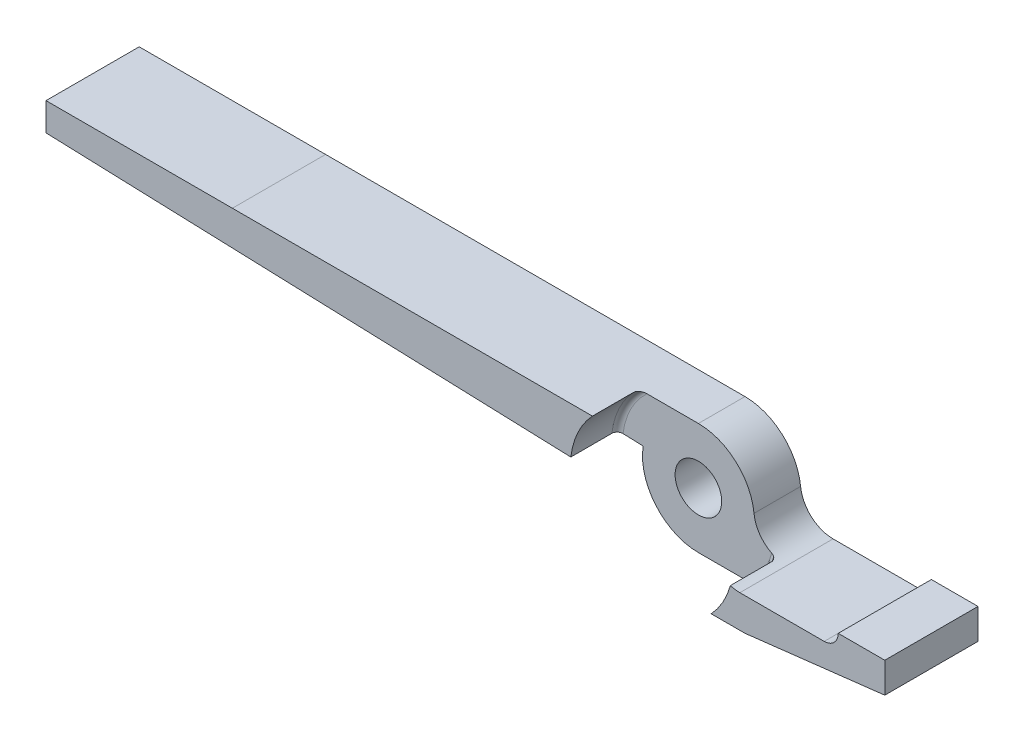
ISO-10303-21;
HEADER;
FILE_DESCRIPTION(('STEP AP214'),'2;1');
FILE_NAME('part.step','',(''),(''),'','','');
FILE_SCHEMA(('AUTOMOTIVE_DESIGN { 1 0 10303 214 1 1 1 1 }'));
ENDSEC;
DATA;
#1=APPLICATION_CONTEXT('core data for automotive mechanical design processes');
#2=APPLICATION_PROTOCOL_DEFINITION('international standard','automotive_design',2000,#1);
#3=PRODUCT_CONTEXT('',#1,'mechanical');
#4=PRODUCT('Part','Part','',(#3));
#5=PRODUCT_RELATED_PRODUCT_CATEGORY('part','',(#4));
#6=PRODUCT_DEFINITION_FORMATION('','',#4);
#7=PRODUCT_DEFINITION_CONTEXT('part definition',#1,'design');
#8=PRODUCT_DEFINITION('design','',#6,#7);
#9=PRODUCT_DEFINITION_SHAPE('','',#8);
#10=(LENGTH_UNIT() NAMED_UNIT(*) SI_UNIT(.MILLI.,.METRE.));
#11=(NAMED_UNIT(*) PLANE_ANGLE_UNIT() SI_UNIT($,.RADIAN.));
#12=(NAMED_UNIT(*) SI_UNIT($,.STERADIAN.) SOLID_ANGLE_UNIT());
#13=UNCERTAINTY_MEASURE_WITH_UNIT(LENGTH_MEASURE(1.E-05),#10,'distance_accuracy_value','');
#14=(GEOMETRIC_REPRESENTATION_CONTEXT(3) GLOBAL_UNCERTAINTY_ASSIGNED_CONTEXT((#13)) GLOBAL_UNIT_ASSIGNED_CONTEXT((#10,
#11,#12)) REPRESENTATION_CONTEXT('',''));
#15=CARTESIAN_POINT('',(0.,0.,0.));
#16=DIRECTION('',(0.,0.,1.));
#17=DIRECTION('',(1.,0.,0.));
#18=AXIS2_PLACEMENT_3D('',#15,#16,#17);
#19=CARTESIAN_POINT('',(-165.1,7.62,25.4));
#20=DIRECTION('',(0.034899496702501,0.999390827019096,0.));
#21=DIRECTION('',(-0.999390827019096,0.034899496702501,0.));
#22=AXIS2_PLACEMENT_3D('',#19,#20,#21);
#23=PLANE('',#22);
#24=DIRECTION('',(0.,0.,1.));
#25=VECTOR('',#24,1.);
#26=CARTESIAN_POINT('',(-160.023094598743,7.44271055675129,25.4));
#27=LINE('',#26,#25);
#28=CARTESIAN_POINT('',(-160.023094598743,7.44271055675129,0.));
#29=VERTEX_POINT('',#28);
#30=CARTESIAN_POINT('',(-160.023094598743,7.44271055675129,25.4));
#31=VERTEX_POINT('',#30);
#32=EDGE_CURVE('E11',#29,#31,#27,.T.);
#33=ORIENTED_EDGE('',*,*,#32,.F.);
#34=DIRECTION('',(0.999390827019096,-0.034899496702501,0.));
#35=VECTOR('',#34,1.);
#36=CARTESIAN_POINT('',(-165.1,7.62,0.));
#37=LINE('',#36,#35);
#38=CARTESIAN_POINT('',(-15.0529746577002,2.38024241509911,0.));
#39=VERTEX_POINT('',#38);
#40=EDGE_CURVE('E282',#29,#39,#37,.T.);
#41=ORIENTED_EDGE('',*,*,#40,.T.);
#42=DIRECTION('',(0.,0.,-1.));
#43=VECTOR('',#42,1.);
#44=CARTESIAN_POINT('',(-15.0529746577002,2.38024241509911,25.4));
#45=LINE('',#44,#43);
#46=CARTESIAN_POINT('',(-15.0529746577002,2.38024241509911,12.7));
#47=VERTEX_POINT('',#46);
#48=EDGE_CURVE('E288',#47,#39,#45,.T.);
#49=ORIENTED_EDGE('',*,*,#48,.F.);
#50=DIRECTION('',(0.999390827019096,-0.034899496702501,0.));
#51=VECTOR('',#50,1.);
#52=CARTESIAN_POINT('',(-165.1,7.62,12.7));
#53=LINE('',#52,#51);
#54=CARTESIAN_POINT('',(-20.5406148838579,2.5718750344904,12.7));
#55=VERTEX_POINT('',#54);
#56=EDGE_CURVE('E212',#55,#47,#53,.T.);
#57=ORIENTED_EDGE('',*,*,#56,.F.);
#58=CARTESIAN_POINT('',(-20.5406148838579,2.57187503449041,12.7));
#59=CARTESIAN_POINT('',(-20.5837496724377,2.57338133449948,12.700000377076));
#60=CARTESIAN_POINT('',(-20.6268638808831,2.57488691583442,12.7018199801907));
#61=CARTESIAN_POINT('',(-20.7127849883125,2.57788734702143,12.7090802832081));
#62=CARTESIAN_POINT('',(-20.7555918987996,2.5793821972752,12.714520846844));
#63=CARTESIAN_POINT('',(-20.8830273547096,2.58383234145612,12.7362260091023));
#64=CARTESIAN_POINT('',(-20.9668041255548,2.58675789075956,12.7578742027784));
#65=CARTESIAN_POINT('',(-21.1295365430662,2.59244063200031,12.8149439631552));
#66=CARTESIAN_POINT('',(-21.2084896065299,2.5951977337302,12.8503728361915));
#67=CARTESIAN_POINT('',(-21.3593097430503,2.60046448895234,12.9340122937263));
#68=CARTESIAN_POINT('',(-21.4311783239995,2.60297419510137,12.9822201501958));
#69=CARTESIAN_POINT('',(-21.5656313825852,2.6076693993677,13.0899565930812));
#70=CARTESIAN_POINT('',(-21.6282341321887,2.60985553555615,13.1494623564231));
#71=CARTESIAN_POINT('',(-21.7425370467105,2.6138470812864,13.2781943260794));
#72=CARTESIAN_POINT('',(-21.7942351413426,2.61565241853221,13.3474223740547));
#73=CARTESIAN_POINT('',(-21.8850550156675,2.61882391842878,13.49336200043));
#74=CARTESIAN_POINT('',(-21.9242187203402,2.6201915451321,13.5700474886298));
#75=CARTESIAN_POINT('',(-21.9890566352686,2.62245573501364,13.7289067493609));
#76=CARTESIAN_POINT('',(-22.014739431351,2.62335259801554,13.811076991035));
#77=CARTESIAN_POINT('',(-22.045309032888,2.62442011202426,13.9488164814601));
#78=CARTESIAN_POINT('',(-22.0543395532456,2.62473546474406,14.0035003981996));
#79=CARTESIAN_POINT('',(-22.0663864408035,2.62515615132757,14.1134483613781));
#80=CARTESIAN_POINT('',(-22.0694113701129,2.62526178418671,14.1687114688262));
#81=CARTESIAN_POINT('',(-22.0694047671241,2.62526155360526,14.224));
#82=B_SPLINE_CURVE_WITH_KNOTS('',3,(#58,#59,#60,#61,#62,#63,#64,#65,#66,#67,#68,#69,#70,#71,#72,
#73,#74,#75,#76,#77,#78,#79,#80,#81),.UNSPECIFIED.,.F.,.F.,(4,2,2,2,2,2,2,2,2,2,2,4),(0.,
0.12940394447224,0.258803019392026,0.51720551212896,0.77574519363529,1.03422972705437,
1.29219754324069,1.5502142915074,1.8073587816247,2.06433930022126,2.23030936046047,
2.39604262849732),.UNSPECIFIED.);
#83=CARTESIAN_POINT('',(-22.0694047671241,2.62526155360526,14.224));
#84=VERTEX_POINT('',#83);
#85=EDGE_CURVE('E349',#55,#84,#82,.T.);
#86=ORIENTED_EDGE('',*,*,#85,.T.);
#87=DIRECTION('',(0.,0.,1.));
#88=VECTOR('',#87,1.);
#89=CARTESIAN_POINT('',(-22.0694047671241,2.62526155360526,12.7));
#90=LINE('',#89,#88);
#91=CARTESIAN_POINT('',(-22.0694047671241,2.62526155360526,25.4));
#92=VERTEX_POINT('',#91);
#93=EDGE_CURVE('E224',#84,#92,#90,.T.);
#94=ORIENTED_EDGE('',*,*,#93,.T.);
#95=DIRECTION('',(0.999390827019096,-0.034899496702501,0.));
#96=VECTOR('',#95,1.);
#97=CARTESIAN_POINT('',(-165.1,7.62,25.4));
#98=LINE('',#97,#96);
#99=EDGE_CURVE('E262',#31,#92,#98,.T.);
#100=ORIENTED_EDGE('',*,*,#99,.F.);
#101=EDGE_LOOP('',(#33,#41,#49,#57,#86,#94,#100));
#102=FACE_BOUND('',#101,.T.);
#103=ADVANCED_FACE('F38',(#102),#23,.F.);
#104=CARTESIAN_POINT('',(-165.1,15.24,25.4));
#105=DIRECTION('',(0.,-1.,0.));
#106=DIRECTION('',(1.,0.,0.));
#107=AXIS2_PLACEMENT_3D('',#104,#105,#106);
#108=PLANE('',#107);
#109=DIRECTION('',(0.,0.,-1.));
#110=VECTOR('',#109,1.);
#111=CARTESIAN_POINT('',(-114.3,15.24,25.4));
#112=LINE('',#111,#110);
#113=CARTESIAN_POINT('',(-114.3,15.24,25.4));
#114=VERTEX_POINT('',#113);
#115=CARTESIAN_POINT('',(-114.3,15.24,0.));
#116=VERTEX_POINT('',#115);
#117=EDGE_CURVE('E47',#114,#116,#112,.T.);
#118=ORIENTED_EDGE('',*,*,#117,.F.);
#119=DIRECTION('',(-1.,0.,0.));
#120=VECTOR('',#119,1.);
#121=CARTESIAN_POINT('',(-165.1,15.24,25.4));
#122=LINE('',#121,#120);
#123=CARTESIAN_POINT('',(-16.1769287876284,15.24,25.4));
#124=VERTEX_POINT('',#123);
#125=EDGE_CURVE('E257',#124,#114,#122,.T.);
#126=ORIENTED_EDGE('',*,*,#125,.F.);
#127=DIRECTION('',(0.,0.,1.));
#128=VECTOR('',#127,1.);
#129=CARTESIAN_POINT('',(-16.1769287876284,15.24,12.7));
#130=LINE('',#129,#128);
#131=CARTESIAN_POINT('',(-16.1769287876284,15.24,14.224));
#132=VERTEX_POINT('',#131);
#133=EDGE_CURVE('E227',#124,#132,#130,.F.);
#134=ORIENTED_EDGE('',*,*,#133,.T.);
#135=CARTESIAN_POINT('',(-16.1769287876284,15.24,14.224));
#136=CARTESIAN_POINT('',(-16.1769395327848,15.24,14.1894360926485));
#137=CARTESIAN_POINT('',(-16.175313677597,15.24,14.1548778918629));
#138=CARTESIAN_POINT('',(-16.1688713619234,15.24,14.0860823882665));
#139=CARTESIAN_POINT('',(-16.1640570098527,15.24,14.0518448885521));
#140=CARTESIAN_POINT('',(-16.1513682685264,15.24,13.984210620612));
#141=CARTESIAN_POINT('',(-16.1435173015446,15.24,13.9508094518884));
#142=CARTESIAN_POINT('',(-16.1249065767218,15.24,13.8848343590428));
#143=CARTESIAN_POINT('',(-16.1141464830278,15.24,13.8522605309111));
#144=CARTESIAN_POINT('',(-16.0778204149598,15.24,13.7562692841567));
#145=CARTESIAN_POINT('',(-16.0481649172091,15.24,13.6943576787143));
#146=CARTESIAN_POINT('',(-15.9796375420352,15.24,13.5758318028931));
#147=CARTESIAN_POINT('',(-15.9407473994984,15.24,13.5192283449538));
#148=CARTESIAN_POINT('',(-15.8398776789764,15.24,13.3923205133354));
#149=CARTESIAN_POINT('',(-15.7746577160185,15.24,13.3245879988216));
#150=CARTESIAN_POINT('',(-15.6341821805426,15.24,13.2005674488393));
#151=CARTESIAN_POINT('',(-15.5589114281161,15.24,13.1442970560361));
#152=CARTESIAN_POINT('',(-15.3716741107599,15.24,13.0236673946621));
#153=CARTESIAN_POINT('',(-15.2565509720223,15.24,12.9642212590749));
#154=CARTESIAN_POINT('',(-15.0182312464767,15.24,12.8642736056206));
#155=CARTESIAN_POINT('',(-14.8950117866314,15.24,12.8238286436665));
#156=CARTESIAN_POINT('',(-14.6450771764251,15.24,12.7604755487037));
#157=CARTESIAN_POINT('',(-14.518391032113,15.24,12.7374515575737));
#158=CARTESIAN_POINT('',(-14.3276172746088,15.24,12.714793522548));
#159=CARTESIAN_POINT('',(-14.2641638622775,15.24,12.7092193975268));
#160=CARTESIAN_POINT('',(-14.1370695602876,15.24,12.7018266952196));
#161=CARTESIAN_POINT('',(-14.073428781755,15.24,12.7000062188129));
#162=CARTESIAN_POINT('',(-14.0097751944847,15.24,12.7));
#163=B_SPLINE_CURVE_WITH_KNOTS('',3,(#135,#136,#137,#138,#139,#140,#141,#142,#143,#144,#145,
#146,#147,#148,#149,#150,#151,#152,#153,#154,#155,#156,#157,#158,#159,#160,#161,#162),
.UNSPECIFIED.,.F.,.F.,(4,2,2,2,2,2,2,2,2,2,2,2,2,4),(0.,0.103644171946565,0.207219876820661,
0.3100121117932,0.412816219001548,0.617747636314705,0.82308781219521,1.10361225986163,
1.38456528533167,1.77115063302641,2.15887945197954,2.54400645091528,2.73500842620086,
2.92591374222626),.UNSPECIFIED.);
#164=CARTESIAN_POINT('',(-14.0097751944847,15.24,12.7));
#165=VERTEX_POINT('',#164);
#166=EDGE_CURVE('E356',#132,#165,#163,.T.);
#167=ORIENTED_EDGE('',*,*,#166,.T.);
#168=DIRECTION('',(-1.,0.,0.));
#169=VECTOR('',#168,1.);
#170=CARTESIAN_POINT('',(-165.1,15.24,12.7));
#171=LINE('',#170,#169);
#172=CARTESIAN_POINT('',(0.,15.24,12.7));
#173=VERTEX_POINT('',#172);
#174=EDGE_CURVE('E217',#173,#165,#171,.T.);
#175=ORIENTED_EDGE('',*,*,#174,.F.);
#176=DIRECTION('',(0.,0.,-1.));
#177=VECTOR('',#176,1.);
#178=CARTESIAN_POINT('',(0.,15.24,25.4));
#179=LINE('',#178,#177);
#180=CARTESIAN_POINT('',(0.,15.24,0.));
#181=VERTEX_POINT('',#180);
#182=EDGE_CURVE('E297',#173,#181,#179,.T.);
#183=ORIENTED_EDGE('',*,*,#182,.T.);
#184=DIRECTION('',(-1.,0.,0.));
#185=VECTOR('',#184,1.);
#186=CARTESIAN_POINT('',(-165.1,15.24,0.));
#187=LINE('',#186,#185);
#188=EDGE_CURVE('E277',#181,#116,#187,.T.);
#189=ORIENTED_EDGE('',*,*,#188,.T.);
#190=EDGE_LOOP('',(#118,#126,#134,#167,#175,#183,#189));
#191=FACE_BOUND('',#190,.T.);
#192=ADVANCED_FACE('F371',(#191),#108,.F.);
#193=CARTESIAN_POINT('',(23.9959434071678,-6.35000000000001,25.4));
#194=DIRECTION('',(0.,-1.,0.));
#195=DIRECTION('',(0.,0.,-1.));
#196=AXIS2_PLACEMENT_3D('',#193,#194,#195);
#197=PLANE('',#196);
#198=DIRECTION('',(-1.,0.,0.));
#199=VECTOR('',#198,1.);
#200=CARTESIAN_POINT('',(23.9959434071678,-6.35000000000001,25.4));
#201=LINE('',#200,#199);
#202=CARTESIAN_POINT('',(46.99,-6.35000000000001,25.4));
#203=VERTEX_POINT('',#202);
#204=CARTESIAN_POINT('',(23.9959434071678,-6.35000000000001,25.4));
#205=VERTEX_POINT('',#204);
#206=EDGE_CURVE('E251',#203,#205,#201,.T.);
#207=ORIENTED_EDGE('',*,*,#206,.F.);
#208=DIRECTION('',(0.,0.,1.));
#209=VECTOR('',#208,1.);
#210=CARTESIAN_POINT('',(46.99,-6.35000000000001,0.));
#211=LINE('',#210,#209);
#212=CARTESIAN_POINT('',(46.99,-6.35000000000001,0.));
#213=VERTEX_POINT('',#212);
#214=EDGE_CURVE('E363',#203,#213,#211,.F.);
#215=ORIENTED_EDGE('',*,*,#214,.T.);
#216=DIRECTION('',(-1.,0.,0.));
#217=VECTOR('',#216,1.);
#218=CARTESIAN_POINT('',(23.9959434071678,-6.35000000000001,0.));
#219=LINE('',#218,#217);
#220=CARTESIAN_POINT('',(23.9959434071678,-6.35000000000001,0.));
#221=VERTEX_POINT('',#220);
#222=EDGE_CURVE('E183',#213,#221,#219,.T.);
#223=ORIENTED_EDGE('',*,*,#222,.T.);
#224=DIRECTION('',(0.,0.,-1.));
#225=VECTOR('',#224,1.);
#226=CARTESIAN_POINT('',(23.9959434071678,-6.35000000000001,25.4));
#227=LINE('',#226,#225);
#228=EDGE_CURVE('E301',#205,#221,#227,.T.);
#229=ORIENTED_EDGE('',*,*,#228,.F.);
#230=EDGE_LOOP('',(#207,#215,#223,#229));
#231=FACE_BOUND('',#230,.T.);
#232=ADVANCED_FACE('F375',(#231),#197,.F.);
#233=CARTESIAN_POINT('',(0.,0.,25.4));
#234=DIRECTION('',(0.,0.,-1.));
#235=DIRECTION('',(-1.,0.,0.));
#236=AXIS2_PLACEMENT_3D('',#233,#234,#235);
#237=CYLINDRICAL_SURFACE('',#236,15.24);
#238=CARTESIAN_POINT('',(0.,0.,12.7));
#239=DIRECTION('',(0.,0.,1.));
#240=DIRECTION('',(1.,0.,0.));
#241=AXIS2_PLACEMENT_3D('',#238,#239,#240);
#242=CIRCLE('',#241,15.24);
#243=CARTESIAN_POINT('',(15.1553326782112,1.60421052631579,12.7));
#244=VERTEX_POINT('',#243);
#245=EDGE_CURVE('E220',#244,#173,#242,.T.);
#246=ORIENTED_EDGE('',*,*,#245,.F.);
#247=DIRECTION('',(0.,0.,-1.));
#248=VECTOR('',#247,1.);
#249=CARTESIAN_POINT('',(15.1553326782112,1.60421052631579,25.4));
#250=LINE('',#249,#248);
#251=CARTESIAN_POINT('',(15.1553326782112,1.60421052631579,0.));
#252=VERTEX_POINT('',#251);
#253=EDGE_CURVE('E299',#244,#252,#250,.T.);
#254=ORIENTED_EDGE('',*,*,#253,.T.);
#255=CARTESIAN_POINT('',(0.,0.,0.));
#256=DIRECTION('',(0.,0.,1.));
#257=DIRECTION('',(1.,0.,0.));
#258=AXIS2_PLACEMENT_3D('',#255,#256,#257);
#259=CIRCLE('',#258,15.24);
#260=EDGE_CURVE('E273',#252,#181,#259,.T.);
#261=ORIENTED_EDGE('',*,*,#260,.T.);
#262=ORIENTED_EDGE('',*,*,#182,.F.);
#263=EDGE_LOOP('',(#246,#254,#261,#262));
#264=FACE_BOUND('',#263,.T.);
#265=ADVANCED_FACE('F372',(#264),#237,.T.);
#266=CARTESIAN_POINT('',(0.,0.,25.4));
#267=DIRECTION('',(0.,0.,-1.));
#268=DIRECTION('',(-1.,0.,0.));
#269=AXIS2_PLACEMENT_3D('',#266,#267,#268);
#270=CYLINDRICAL_SURFACE('',#269,15.24);
#271=CARTESIAN_POINT('',(0.,0.,12.7));
#272=DIRECTION('',(0.,0.,1.));
#273=DIRECTION('',(1.,0.,0.));
#274=AXIS2_PLACEMENT_3D('',#271,#272,#273);
#275=CIRCLE('',#274,15.24);
#276=CARTESIAN_POINT('',(0.,-15.24,12.7));
#277=VERTEX_POINT('',#276);
#278=EDGE_CURVE('E210',#47,#277,#275,.T.);
#279=ORIENTED_EDGE('',*,*,#278,.F.);
#280=ORIENTED_EDGE('',*,*,#48,.T.);
#281=CARTESIAN_POINT('',(0.,0.,0.));
#282=DIRECTION('',(0.,0.,1.));
#283=DIRECTION('',(1.,0.,0.));
#284=AXIS2_PLACEMENT_3D('',#281,#282,#283);
#285=CIRCLE('',#284,15.24);
#286=CARTESIAN_POINT('',(0.,-15.24,0.));
#287=VERTEX_POINT('',#286);
#288=EDGE_CURVE('E249',#39,#287,#285,.T.);
#289=ORIENTED_EDGE('',*,*,#288,.T.);
#290=DIRECTION('',(0.,0.,-1.));
#291=VECTOR('',#290,1.);
#292=CARTESIAN_POINT('',(0.,-15.24,25.4));
#293=LINE('',#292,#291);
#294=EDGE_CURVE('E266',#277,#287,#293,.T.);
#295=ORIENTED_EDGE('',*,*,#294,.F.);
#296=EDGE_LOOP('',(#279,#280,#289,#295));
#297=FACE_BOUND('',#296,.T.);
#298=ADVANCED_FACE('F374',(#297),#270,.T.);
#299=CARTESIAN_POINT('',(23.9959434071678,2.53999999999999,25.4));
#300=DIRECTION('',(0.,0.,1.));
#301=DIRECTION('',(1.,0.,0.));
#302=AXIS2_PLACEMENT_3D('',#299,#300,#301);
#303=PLANE('',#302);
#304=CARTESIAN_POINT('',(0.,0.,25.4));
#305=DIRECTION('',(0.,0.,1.));
#306=DIRECTION('',(1.,0.,0.));
#307=AXIS2_PLACEMENT_3D('',#304,#305,#306);
#308=CIRCLE('',#307,22.225);
#309=EDGE_CURVE('E206',#124,#92,#308,.T.);
#310=ORIENTED_EDGE('',*,*,#309,.F.);
#311=ORIENTED_EDGE('',*,*,#125,.T.);
#312=CARTESIAN_POINT('',(-165.1,15.24,25.4));
#313=VERTEX_POINT('',#312);
#314=EDGE_CURVE('E256',#114,#313,#122,.T.);
#315=ORIENTED_EDGE('',*,*,#314,.T.);
#316=DIRECTION('',(0.,-1.,0.));
#317=VECTOR('',#316,1.);
#318=CARTESIAN_POINT('',(-165.1,7.62,25.4));
#319=LINE('',#318,#317);
#320=CARTESIAN_POINT('',(-165.1,7.62,25.4));
#321=VERTEX_POINT('',#320);
#322=EDGE_CURVE('E260',#313,#321,#319,.T.);
#323=ORIENTED_EDGE('',*,*,#322,.T.);
#324=EDGE_CURVE('E263',#321,#31,#98,.T.);
#325=ORIENTED_EDGE('',*,*,#324,.T.);
#326=ORIENTED_EDGE('',*,*,#99,.T.);
#327=EDGE_LOOP('',(#310,#311,#315,#323,#325,#326));
#328=FACE_BOUND('',#327,.T.);
#329=ADVANCED_FACE('F381',(#328),#303,.T.);
#330=CARTESIAN_POINT('',(0.,0.,0.));
#331=DIRECTION('',(0.,0.,1.));
#332=DIRECTION('',(1.,0.,0.));
#333=AXIS2_PLACEMENT_3D('',#330,#331,#332);
#334=CYLINDRICAL_SURFACE('',#333,6.35);
#335=CARTESIAN_POINT('',(0.,0.,0.));
#336=DIRECTION('',(0.,0.,1.));
#337=DIRECTION('',(1.,0.,0.));
#338=AXIS2_PLACEMENT_3D('',#335,#336,#337);
#339=CIRCLE('',#338,6.35);
#340=CARTESIAN_POINT('',(6.35,0.,0.));
#341=VERTEX_POINT('',#340);
#342=EDGE_CURVE('E235',#341,#341,#339,.T.);
#343=ORIENTED_EDGE('',*,*,#342,.F.);
#344=EDGE_LOOP('',(#343));
#345=FACE_BOUND('',#344,.T.);
#346=CARTESIAN_POINT('',(0.,0.,12.7));
#347=DIRECTION('',(0.,0.,1.));
#348=DIRECTION('',(1.,0.,0.));
#349=AXIS2_PLACEMENT_3D('',#346,#347,#348);
#350=CIRCLE('',#349,6.35);
#351=CARTESIAN_POINT('',(6.35,0.,12.7));
#352=VERTEX_POINT('',#351);
#353=EDGE_CURVE('E209',#352,#352,#350,.F.);
#354=ORIENTED_EDGE('',*,*,#353,.F.);
#355=EDGE_LOOP('',(#354));
#356=FACE_BOUND('',#355,.T.);
#357=ADVANCED_FACE('F443',(#345,#356),#334,.F.);
#358=CARTESIAN_POINT('',(0.,-15.24,25.4));
#359=DIRECTION('',(0.,1.,0.));
#360=DIRECTION('',(-1.,0.,0.));
#361=AXIS2_PLACEMENT_3D('',#358,#359,#360);
#362=PLANE('',#361);
#363=DIRECTION('',(1.,0.,0.));
#364=VECTOR('',#363,1.);
#365=CARTESIAN_POINT('',(0.,-15.24,25.4));
#366=LINE('',#365,#364);
#367=CARTESIAN_POINT('',(16.1769287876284,-15.24,25.4));
#368=VERTEX_POINT('',#367);
#369=CARTESIAN_POINT('',(25.4,-15.24,25.4));
#370=VERTEX_POINT('',#369);
#371=EDGE_CURVE('E246',#368,#370,#366,.T.);
#372=ORIENTED_EDGE('',*,*,#371,.F.);
#373=DIRECTION('',(0.,0.,1.));
#374=VECTOR('',#373,1.);
#375=CARTESIAN_POINT('',(16.1769287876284,-15.24,12.7));
#376=LINE('',#375,#374);
#377=CARTESIAN_POINT('',(16.1769287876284,-15.24,14.224));
#378=VERTEX_POINT('',#377);
#379=EDGE_CURVE('E232',#368,#378,#376,.F.);
#380=ORIENTED_EDGE('',*,*,#379,.T.);
#381=CARTESIAN_POINT('',(16.1769287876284,-15.24,14.224));
#382=CARTESIAN_POINT('',(16.1769395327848,-15.24,14.1894360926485));
#383=CARTESIAN_POINT('',(16.175313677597,-15.24,14.1548778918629));
#384=CARTESIAN_POINT('',(16.1688713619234,-15.24,14.0860823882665));
#385=CARTESIAN_POINT('',(16.1640570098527,-15.24,14.0518448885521));
#386=CARTESIAN_POINT('',(16.1513682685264,-15.24,13.984210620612));
#387=CARTESIAN_POINT('',(16.1435173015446,-15.24,13.9508094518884));
#388=CARTESIAN_POINT('',(16.1249065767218,-15.24,13.8848343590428));
#389=CARTESIAN_POINT('',(16.1141464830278,-15.24,13.8522605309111));
#390=CARTESIAN_POINT('',(16.0778204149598,-15.24,13.7562692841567));
#391=CARTESIAN_POINT('',(16.0481649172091,-15.24,13.6943576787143));
#392=CARTESIAN_POINT('',(15.9796375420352,-15.24,13.5758318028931));
#393=CARTESIAN_POINT('',(15.9407473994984,-15.24,13.5192283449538));
#394=CARTESIAN_POINT('',(15.8398776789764,-15.24,13.3923205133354));
#395=CARTESIAN_POINT('',(15.7746577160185,-15.24,13.3245879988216));
#396=CARTESIAN_POINT('',(15.6341821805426,-15.24,13.2005674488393));
#397=CARTESIAN_POINT('',(15.5589114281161,-15.24,13.1442970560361));
#398=CARTESIAN_POINT('',(15.3716741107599,-15.24,13.0236673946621));
#399=CARTESIAN_POINT('',(15.2565509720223,-15.24,12.9642212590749));
#400=CARTESIAN_POINT('',(15.0182312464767,-15.24,12.8642736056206));
#401=CARTESIAN_POINT('',(14.8950117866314,-15.24,12.8238286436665));
#402=CARTESIAN_POINT('',(14.6450771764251,-15.24,12.7604755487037));
#403=CARTESIAN_POINT('',(14.518391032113,-15.24,12.7374515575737));
#404=CARTESIAN_POINT('',(14.3276172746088,-15.24,12.714793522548));
#405=CARTESIAN_POINT('',(14.2641638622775,-15.24,12.7092193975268));
#406=CARTESIAN_POINT('',(14.1370695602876,-15.24,12.7018266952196));
#407=CARTESIAN_POINT('',(14.073428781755,-15.24,12.7000062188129));
#408=CARTESIAN_POINT('',(14.0097751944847,-15.24,12.7));
#409=B_SPLINE_CURVE_WITH_KNOTS('',3,(#381,#382,#383,#384,#385,#386,#387,#388,#389,#390,#391,
#392,#393,#394,#395,#396,#397,#398,#399,#400,#401,#402,#403,#404,#405,#406,#407,#408),
.UNSPECIFIED.,.F.,.F.,(4,2,2,2,2,2,2,2,2,2,2,2,2,4),(0.,0.103644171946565,0.207219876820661,
0.3100121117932,0.412816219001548,0.617747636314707,0.82308781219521,1.10361225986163,
1.38456528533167,1.77115063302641,2.15887945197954,2.54400645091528,2.73500842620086,
2.92591374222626),.UNSPECIFIED.);
#410=CARTESIAN_POINT('',(14.0097751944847,-15.24,12.7));
#411=VERTEX_POINT('',#410);
#412=EDGE_CURVE('E324',#378,#411,#409,.T.);
#413=ORIENTED_EDGE('',*,*,#412,.T.);
#414=DIRECTION('',(1.,0.,0.));
#415=VECTOR('',#414,1.);
#416=CARTESIAN_POINT('',(0.,-15.24,12.7));
#417=LINE('',#416,#415);
#418=EDGE_CURVE('E214',#277,#411,#417,.T.);
#419=ORIENTED_EDGE('',*,*,#418,.F.);
#420=ORIENTED_EDGE('',*,*,#294,.T.);
#421=DIRECTION('',(1.,0.,0.));
#422=VECTOR('',#421,1.);
#423=CARTESIAN_POINT('',(0.,-15.24,0.));
#424=LINE('',#423,#422);
#425=CARTESIAN_POINT('',(25.4,-15.24,0.));
#426=VERTEX_POINT('',#425);
#427=EDGE_CURVE('E184',#287,#426,#424,.T.);
#428=ORIENTED_EDGE('',*,*,#427,.T.);
#429=DIRECTION('',(0.,0.,-1.));
#430=VECTOR('',#429,1.);
#431=CARTESIAN_POINT('',(25.4,-15.24,25.4));
#432=LINE('',#431,#430);
#433=EDGE_CURVE('E242',#370,#426,#432,.T.);
#434=ORIENTED_EDGE('',*,*,#433,.F.);
#435=EDGE_LOOP('',(#372,#380,#413,#419,#420,#428,#434));
#436=FACE_BOUND('',#435,.T.);
#437=ADVANCED_FACE('F341',(#436),#362,.F.);
#438=CARTESIAN_POINT('',(63.5,-6.35000000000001,25.4));
#439=DIRECTION('',(-1.,0.,0.));
#440=DIRECTION('',(0.,-1.,0.));
#441=AXIS2_PLACEMENT_3D('',#438,#439,#440);
#442=PLANE('',#441);
#443=DIRECTION('',(0.,1.,0.));
#444=VECTOR('',#443,1.);
#445=CARTESIAN_POINT('',(63.5,-6.35000000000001,25.4));
#446=LINE('',#445,#444);
#447=CARTESIAN_POINT('',(63.5,-10.795,25.4));
#448=VERTEX_POINT('',#447);
#449=CARTESIAN_POINT('',(63.5,-2.54000000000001,25.4));
#450=VERTEX_POINT('',#449);
#451=EDGE_CURVE('E248',#448,#450,#446,.T.);
#452=ORIENTED_EDGE('',*,*,#451,.F.);
#453=DIRECTION('',(0.,0.,-1.));
#454=VECTOR('',#453,1.);
#455=CARTESIAN_POINT('',(63.5,-10.795,25.4));
#456=LINE('',#455,#454);
#457=CARTESIAN_POINT('',(63.5,-10.795,0.));
#458=VERTEX_POINT('',#457);
#459=EDGE_CURVE('E180',#448,#458,#456,.T.);
#460=ORIENTED_EDGE('',*,*,#459,.T.);
#461=DIRECTION('',(0.,1.,0.));
#462=VECTOR('',#461,1.);
#463=CARTESIAN_POINT('',(63.5,-6.35000000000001,0.));
#464=LINE('',#463,#462);
#465=CARTESIAN_POINT('',(63.5,-2.54000000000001,0.));
#466=VERTEX_POINT('',#465);
#467=EDGE_CURVE('E174',#458,#466,#464,.T.);
#468=ORIENTED_EDGE('',*,*,#467,.T.);
#469=DIRECTION('',(0.,0.,-1.));
#470=VECTOR('',#469,1.);
#471=CARTESIAN_POINT('',(63.5,-2.54000000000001,25.4));
#472=LINE('',#471,#470);
#473=EDGE_CURVE('E179',#450,#466,#472,.T.);
#474=ORIENTED_EDGE('',*,*,#473,.F.);
#475=EDGE_LOOP('',(#452,#460,#468,#474));
#476=FACE_BOUND('',#475,.T.);
#477=ADVANCED_FACE('F177',(#476),#442,.F.);
#478=CARTESIAN_POINT('',(23.9959434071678,2.53999999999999,25.4));
#479=DIRECTION('',(0.,0.,-1.));
#480=DIRECTION('',(-1.,0.,0.));
#481=AXIS2_PLACEMENT_3D('',#478,#479,#480);
#482=CYLINDRICAL_SURFACE('',#481,8.89);
#483=CARTESIAN_POINT('',(23.9959434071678,2.53999999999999,12.7));
#484=DIRECTION('',(0.,0.,1.));
#485=DIRECTION('',(1.,0.,0.));
#486=AXIS2_PLACEMENT_3D('',#483,#484,#485);
#487=CIRCLE('',#486,8.89);
#488=CARTESIAN_POINT('',(19.98584992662,-5.39418239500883,12.7));
#489=VERTEX_POINT('',#488);
#490=EDGE_CURVE('E222',#489,#244,#487,.F.);
#491=ORIENTED_EDGE('',*,*,#490,.F.);
#492=CARTESIAN_POINT('',(19.98584992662,-5.39418239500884,12.7));
#493=CARTESIAN_POINT('',(20.024285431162,-5.41361029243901,12.7000002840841));
#494=CARTESIAN_POINT('',(20.0628475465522,-5.43274741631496,12.7017516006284));
#495=CARTESIAN_POINT('',(20.1399873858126,-5.47033960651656,12.7087729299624));
#496=CARTESIAN_POINT('',(20.1785651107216,-5.48879461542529,12.7140432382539));
#497=CARTESIAN_POINT('',(20.2938597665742,-5.54293590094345,12.7351396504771));
#498=CARTESIAN_POINT('',(20.3702350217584,-5.5774472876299,12.7562511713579));
#499=CARTESIAN_POINT('',(20.5196231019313,-5.64254009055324,12.8122103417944));
#500=CARTESIAN_POINT('',(20.592632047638,-5.67311704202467,12.8470734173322));
#501=CARTESIAN_POINT('',(20.7328558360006,-5.72982945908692,12.9296438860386));
#502=CARTESIAN_POINT('',(20.8000730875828,-5.75596677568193,12.9773459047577));
#503=CARTESIAN_POINT('',(20.9257535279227,-5.80329071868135,13.0836202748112));
#504=CARTESIAN_POINT('',(20.9843124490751,-5.8245332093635,13.1420547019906));
#505=CARTESIAN_POINT('',(21.091761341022,-5.86244494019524,13.268539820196));
#506=CARTESIAN_POINT('',(21.1406487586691,-5.8791129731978,13.336593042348));
#507=CARTESIAN_POINT('',(21.2271934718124,-5.90797102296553,13.4804268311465));
#508=CARTESIAN_POINT('',(21.2648415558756,-5.9201573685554,13.5562136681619));
#509=CARTESIAN_POINT('',(21.3276321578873,-5.94017138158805,13.7133197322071));
#510=CARTESIAN_POINT('',(21.3527812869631,-5.94800135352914,13.7946360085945));
#511=CARTESIAN_POINT('',(21.3839519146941,-5.95763365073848,13.9343097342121));
#512=CARTESIAN_POINT('',(21.3935032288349,-5.9605577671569,13.9918303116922));
#513=CARTESIAN_POINT('',(21.4062519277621,-5.96444646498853,14.1075595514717));
#514=CARTESIAN_POINT('',(21.4094576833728,-5.96541362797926,14.1657672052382));
#515=CARTESIAN_POINT('',(21.4094468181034,-5.96541800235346,14.224));
#516=B_SPLINE_CURVE_WITH_KNOTS('',3,(#492,#493,#494,#495,#496,#497,#498,#499,#500,#501,#502,
#503,#504,#505,#506,#507,#508,#509,#510,#511,#512,#513,#514,#515),.UNSPECIFIED.,.F.,.F.,(4,2,2,
2,2,2,2,2,2,2,2,4),(0.,0.12912543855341,0.258261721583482,0.516212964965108,0.774454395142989,
1.03258789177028,1.28761066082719,1.54270066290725,1.79799915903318,2.05316247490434,
2.22794668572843,2.40250017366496),.UNSPECIFIED.);
#517=CARTESIAN_POINT('',(21.4094468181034,-5.96541800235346,14.224));
#518=VERTEX_POINT('',#517);
#519=EDGE_CURVE('E316',#489,#518,#516,.T.);
#520=ORIENTED_EDGE('',*,*,#519,.T.);
#521=DIRECTION('',(0.,0.,1.));
#522=VECTOR('',#521,1.);
#523=CARTESIAN_POINT('',(21.4094468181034,-5.96541800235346,19.05));
#524=LINE('',#523,#522);
#525=CARTESIAN_POINT('',(21.4094468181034,-5.96541800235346,25.4));
#526=VERTEX_POINT('',#525);
#527=EDGE_CURVE('E230',#518,#526,#524,.T.);
#528=ORIENTED_EDGE('',*,*,#527,.T.);
#529=CARTESIAN_POINT('',(23.9959434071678,2.53999999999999,25.4));
#530=DIRECTION('',(0.,0.,-1.));
#531=DIRECTION('',(1.,0.,0.));
#532=AXIS2_PLACEMENT_3D('',#529,#530,#531);
#533=CIRCLE('',#532,8.89);
#534=EDGE_CURVE('E253',#205,#526,#533,.T.);
#535=ORIENTED_EDGE('',*,*,#534,.F.);
#536=ORIENTED_EDGE('',*,*,#228,.T.);
#537=CARTESIAN_POINT('',(23.9959434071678,2.53999999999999,0.));
#538=DIRECTION('',(0.,0.,-1.));
#539=DIRECTION('',(1.,0.,0.));
#540=AXIS2_PLACEMENT_3D('',#537,#538,#539);
#541=CIRCLE('',#540,8.89);
#542=EDGE_CURVE('E270',#221,#252,#541,.T.);
#543=ORIENTED_EDGE('',*,*,#542,.T.);
#544=ORIENTED_EDGE('',*,*,#253,.F.);
#545=EDGE_LOOP('',(#491,#520,#528,#535,#536,#543,#544));
#546=FACE_BOUND('',#545,.T.);
#547=ADVANCED_FACE('F331',(#546),#482,.F.);
#548=ORIENTED_EDGE('',*,*,#314,.F.);
#549=ORIENTED_EDGE('',*,*,#117,.T.);
#550=CARTESIAN_POINT('',(-165.1,15.24,0.));
#551=VERTEX_POINT('',#550);
#552=EDGE_CURVE('E276',#116,#551,#187,.T.);
#553=ORIENTED_EDGE('',*,*,#552,.T.);
#554=DIRECTION('',(0.,0.,-1.));
#555=VECTOR('',#554,1.);
#556=CARTESIAN_POINT('',(-165.1,15.24,25.4));
#557=LINE('',#556,#555);
#558=EDGE_CURVE('E294',#313,#551,#557,.T.);
#559=ORIENTED_EDGE('',*,*,#558,.F.);
#560=EDGE_LOOP('',(#548,#549,#553,#559));
#561=FACE_BOUND('',#560,.T.);
#562=ADVANCED_FACE('F365',(#561),#108,.F.);
#563=CARTESIAN_POINT('',(-165.1,7.62,25.4));
#564=DIRECTION('',(1.,0.,0.));
#565=DIRECTION('',(0.,0.,-1.));
#566=AXIS2_PLACEMENT_3D('',#563,#564,#565);
#567=PLANE('',#566);
#568=DIRECTION('',(0.,-1.,0.));
#569=VECTOR('',#568,1.);
#570=CARTESIAN_POINT('',(-165.1,7.62,0.));
#571=LINE('',#570,#569);
#572=CARTESIAN_POINT('',(-165.1,7.62,0.));
#573=VERTEX_POINT('',#572);
#574=EDGE_CURVE('E280',#551,#573,#571,.T.);
#575=ORIENTED_EDGE('',*,*,#574,.T.);
#576=DIRECTION('',(0.,0.,-1.));
#577=VECTOR('',#576,1.);
#578=CARTESIAN_POINT('',(-165.1,7.62,25.4));
#579=LINE('',#578,#577);
#580=EDGE_CURVE('E291',#321,#573,#579,.T.);
#581=ORIENTED_EDGE('',*,*,#580,.F.);
#582=ORIENTED_EDGE('',*,*,#322,.F.);
#583=ORIENTED_EDGE('',*,*,#558,.T.);
#584=EDGE_LOOP('',(#575,#581,#582,#583));
#585=FACE_BOUND('',#584,.T.);
#586=ADVANCED_FACE('F369',(#585),#567,.F.);
#587=EDGE_CURVE('E283',#573,#29,#37,.T.);
#588=ORIENTED_EDGE('',*,*,#587,.T.);
#589=ORIENTED_EDGE('',*,*,#32,.T.);
#590=ORIENTED_EDGE('',*,*,#324,.F.);
#591=ORIENTED_EDGE('',*,*,#580,.T.);
#592=EDGE_LOOP('',(#588,#589,#590,#591));
#593=FACE_BOUND('',#592,.T.);
#594=ADVANCED_FACE('F387',(#593),#23,.F.);
#595=EDGE_CURVE('E205',#368,#526,#308,.T.);
#596=ORIENTED_EDGE('',*,*,#595,.F.);
#597=ORIENTED_EDGE('',*,*,#371,.T.);
#598=DIRECTION('',(0.993263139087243,0.115880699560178,0.));
#599=VECTOR('',#598,1.);
#600=CARTESIAN_POINT('',(63.5,-10.795,25.4));
#601=LINE('',#600,#599);
#602=EDGE_CURVE('E239',#370,#448,#601,.T.);
#603=ORIENTED_EDGE('',*,*,#602,.T.);
#604=ORIENTED_EDGE('',*,*,#451,.T.);
#605=DIRECTION('',(1.,0.,0.));
#606=VECTOR('',#605,1.);
#607=CARTESIAN_POINT('',(50.8,-2.54000000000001,25.4));
#608=LINE('',#607,#606);
#609=CARTESIAN_POINT('',(50.8,-2.54000000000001,25.4));
#610=VERTEX_POINT('',#609);
#611=EDGE_CURVE('E200',#610,#450,#608,.T.);
#612=ORIENTED_EDGE('',*,*,#611,.F.);
#613=CARTESIAN_POINT('',(46.99,-2.54000000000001,25.4));
#614=DIRECTION('',(0.,0.,1.));
#615=DIRECTION('',(1.,0.,0.));
#616=AXIS2_PLACEMENT_3D('',#613,#614,#615);
#617=CIRCLE('',#616,3.81);
#618=EDGE_CURVE('E478',#610,#203,#617,.F.);
#619=ORIENTED_EDGE('',*,*,#618,.T.);
#620=ORIENTED_EDGE('',*,*,#206,.T.);
#621=ORIENTED_EDGE('',*,*,#534,.T.);
#622=EDGE_LOOP('',(#596,#597,#603,#604,#612,#619,#620,#621));
#623=FACE_BOUND('',#622,.T.);
#624=ADVANCED_FACE('F394',(#623),#303,.T.);
#625=CARTESIAN_POINT('',(23.9959434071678,2.53999999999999,0.));
#626=DIRECTION('',(0.,0.,1.));
#627=DIRECTION('',(1.,0.,0.));
#628=AXIS2_PLACEMENT_3D('',#625,#626,#627);
#629=PLANE('',#628);
#630=ORIENTED_EDGE('',*,*,#342,.T.);
#631=EDGE_LOOP('',(#630));
#632=FACE_BOUND('',#631,.T.);
#633=ORIENTED_EDGE('',*,*,#467,.F.);
#634=DIRECTION('',(0.993263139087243,0.115880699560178,0.));
#635=VECTOR('',#634,1.);
#636=CARTESIAN_POINT('',(63.5,-10.795,0.));
#637=LINE('',#636,#635);
#638=EDGE_CURVE('E238',#426,#458,#637,.T.);
#639=ORIENTED_EDGE('',*,*,#638,.F.);
#640=ORIENTED_EDGE('',*,*,#427,.F.);
#641=ORIENTED_EDGE('',*,*,#288,.F.);
#642=ORIENTED_EDGE('',*,*,#40,.F.);
#643=ORIENTED_EDGE('',*,*,#587,.F.);
#644=ORIENTED_EDGE('',*,*,#574,.F.);
#645=ORIENTED_EDGE('',*,*,#552,.F.);
#646=ORIENTED_EDGE('',*,*,#188,.F.);
#647=ORIENTED_EDGE('',*,*,#260,.F.);
#648=ORIENTED_EDGE('',*,*,#542,.F.);
#649=ORIENTED_EDGE('',*,*,#222,.F.);
#650=CARTESIAN_POINT('',(46.99,-2.54000000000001,0.));
#651=DIRECTION('',(0.,0.,1.));
#652=DIRECTION('',(1.,0.,0.));
#653=AXIS2_PLACEMENT_3D('',#650,#651,#652);
#654=CIRCLE('',#653,3.81);
#655=CARTESIAN_POINT('',(50.8,-2.54000000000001,0.));
#656=VERTEX_POINT('',#655);
#657=EDGE_CURVE('E191',#213,#656,#654,.T.);
#658=ORIENTED_EDGE('',*,*,#657,.T.);
#659=DIRECTION('',(-1.,0.,0.));
#660=VECTOR('',#659,1.);
#661=CARTESIAN_POINT('',(63.5,-2.54000000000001,0.));
#662=LINE('',#661,#660);
#663=EDGE_CURVE('E187',#466,#656,#662,.T.);
#664=ORIENTED_EDGE('',*,*,#663,.F.);
#665=EDGE_LOOP('',(#633,#639,#640,#641,#642,#643,#644,#645,#646,#647,#648,#649,#658,#664));
#666=FACE_BOUND('',#665,.T.);
#667=ADVANCED_FACE('F188',(#632,#666),#629,.F.);
#668=CARTESIAN_POINT('',(63.5,-10.795,25.4));
#669=DIRECTION('',(-0.115880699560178,0.993263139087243,0.));
#670=DIRECTION('',(-0.993263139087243,-0.115880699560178,0.));
#671=AXIS2_PLACEMENT_3D('',#668,#669,#670);
#672=PLANE('',#671);
#673=ORIENTED_EDGE('',*,*,#638,.T.);
#674=ORIENTED_EDGE('',*,*,#459,.F.);
#675=ORIENTED_EDGE('',*,*,#602,.F.);
#676=ORIENTED_EDGE('',*,*,#433,.T.);
#677=EDGE_LOOP('',(#673,#674,#675,#676));
#678=FACE_BOUND('',#677,.T.);
#679=ADVANCED_FACE('F451',(#678),#672,.F.);
#680=CARTESIAN_POINT('',(0.,0.,12.7));
#681=DIRECTION('',(0.,0.,1.));
#682=DIRECTION('',(1.,0.,0.));
#683=AXIS2_PLACEMENT_3D('',#680,#681,#682);
#684=CYLINDRICAL_SURFACE('',#683,22.225);
#685=ORIENTED_EDGE('',*,*,#527,.F.);
#686=CARTESIAN_POINT('',(0.,0.,14.224));
#687=DIRECTION('',(0.,0.,1.));
#688=DIRECTION('',(1.,0.,0.));
#689=AXIS2_PLACEMENT_3D('',#686,#687,#688);
#690=CIRCLE('',#689,22.225);
#691=EDGE_CURVE('E312',#518,#378,#690,.F.);
#692=ORIENTED_EDGE('',*,*,#691,.T.);
#693=ORIENTED_EDGE('',*,*,#379,.F.);
#694=ORIENTED_EDGE('',*,*,#595,.T.);
#695=EDGE_LOOP('',(#685,#692,#693,#694));
#696=FACE_BOUND('',#695,.T.);
#697=ADVANCED_FACE('F457',(#696),#684,.F.);
#698=ORIENTED_EDGE('',*,*,#93,.F.);
#699=CARTESIAN_POINT('',(0.,0.,14.224));
#700=DIRECTION('',(0.,0.,1.));
#701=DIRECTION('',(1.,0.,0.));
#702=AXIS2_PLACEMENT_3D('',#699,#700,#701);
#703=CIRCLE('',#702,22.225);
#704=EDGE_CURVE('E314',#84,#132,#703,.F.);
#705=ORIENTED_EDGE('',*,*,#704,.T.);
#706=ORIENTED_EDGE('',*,*,#133,.F.);
#707=ORIENTED_EDGE('',*,*,#309,.T.);
#708=EDGE_LOOP('',(#698,#705,#706,#707));
#709=FACE_BOUND('',#708,.T.);
#710=ADVANCED_FACE('F423',(#709),#684,.F.);
#711=CARTESIAN_POINT('',(0.,0.,12.7));
#712=DIRECTION('',(0.,0.,1.));
#713=DIRECTION('',(1.,0.,0.));
#714=AXIS2_PLACEMENT_3D('',#711,#712,#713);
#715=PLANE('',#714);
#716=ORIENTED_EDGE('',*,*,#353,.T.);
#717=EDGE_LOOP('',(#716));
#718=FACE_BOUND('',#717,.T.);
#719=ORIENTED_EDGE('',*,*,#418,.T.);
#720=CARTESIAN_POINT('',(0.,0.,12.7));
#721=DIRECTION('',(0.,0.,1.));
#722=DIRECTION('',(1.,0.,0.));
#723=AXIS2_PLACEMENT_3D('',#720,#721,#722);
#724=CIRCLE('',#723,20.701);
#725=EDGE_CURVE('E309',#411,#489,#724,.T.);
#726=ORIENTED_EDGE('',*,*,#725,.T.);
#727=ORIENTED_EDGE('',*,*,#490,.T.);
#728=ORIENTED_EDGE('',*,*,#245,.T.);
#729=ORIENTED_EDGE('',*,*,#174,.T.);
#730=CARTESIAN_POINT('',(0.,0.,12.7));
#731=DIRECTION('',(0.,0.,1.));
#732=DIRECTION('',(1.,0.,0.));
#733=AXIS2_PLACEMENT_3D('',#730,#731,#732);
#734=CIRCLE('',#733,20.701);
#735=EDGE_CURVE('E304',#165,#55,#734,.T.);
#736=ORIENTED_EDGE('',*,*,#735,.T.);
#737=ORIENTED_EDGE('',*,*,#56,.T.);
#738=ORIENTED_EDGE('',*,*,#278,.T.);
#739=EDGE_LOOP('',(#719,#726,#727,#728,#729,#736,#737,#738));
#740=FACE_BOUND('',#739,.T.);
#741=ADVANCED_FACE('F339',(#718,#740),#715,.T.);
#742=CARTESIAN_POINT('',(0.,0.,14.224));
#743=DIRECTION('',(0.,0.,1.));
#744=DIRECTION('',(1.,0.,0.));
#745=AXIS2_PLACEMENT_3D('',#742,#743,#744);
#746=TOROIDAL_SURFACE('',#745,20.701,1.524);
#747=ORIENTED_EDGE('',*,*,#412,.F.);
#748=ORIENTED_EDGE('',*,*,#691,.F.);
#749=ORIENTED_EDGE('',*,*,#519,.F.);
#750=ORIENTED_EDGE('',*,*,#725,.F.);
#751=EDGE_LOOP('',(#747,#748,#749,#750));
#752=FACE_BOUND('',#751,.T.);
#753=ADVANCED_FACE('F335',(#752),#746,.F.);
#754=CARTESIAN_POINT('',(0.,0.,14.224));
#755=DIRECTION('',(0.,0.,1.));
#756=DIRECTION('',(1.,0.,0.));
#757=AXIS2_PLACEMENT_3D('',#754,#755,#756);
#758=TOROIDAL_SURFACE('',#757,20.701,1.524);
#759=ORIENTED_EDGE('',*,*,#166,.F.);
#760=ORIENTED_EDGE('',*,*,#704,.F.);
#761=ORIENTED_EDGE('',*,*,#85,.F.);
#762=ORIENTED_EDGE('',*,*,#735,.F.);
#763=EDGE_LOOP('',(#759,#760,#761,#762));
#764=FACE_BOUND('',#763,.T.);
#765=ADVANCED_FACE('F338',(#764),#758,.F.);
#766=CARTESIAN_POINT('',(63.5,-2.54000000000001,0.));
#767=DIRECTION('',(0.,1.,0.));
#768=DIRECTION('',(0.,0.,1.));
#769=AXIS2_PLACEMENT_3D('',#766,#767,#768);
#770=PLANE('',#769);
#771=ORIENTED_EDGE('',*,*,#473,.T.);
#772=ORIENTED_EDGE('',*,*,#663,.T.);
#773=DIRECTION('',(0.,0.,1.));
#774=VECTOR('',#773,1.);
#775=CARTESIAN_POINT('',(50.8,-2.54000000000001,25.4));
#776=LINE('',#775,#774);
#777=EDGE_CURVE('E195',#656,#610,#776,.T.);
#778=ORIENTED_EDGE('',*,*,#777,.T.);
#779=ORIENTED_EDGE('',*,*,#611,.T.);
#780=EDGE_LOOP('',(#771,#772,#778,#779));
#781=FACE_BOUND('',#780,.T.);
#782=ADVANCED_FACE('F198',(#781),#770,.T.);
#783=CARTESIAN_POINT('',(46.99,-2.54000000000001,25.4));
#784=DIRECTION('',(0.,0.,-1.));
#785=DIRECTION('',(-1.,0.,0.));
#786=AXIS2_PLACEMENT_3D('',#783,#784,#785);
#787=CYLINDRICAL_SURFACE('',#786,3.81);
#788=ORIENTED_EDGE('',*,*,#657,.F.);
#789=ORIENTED_EDGE('',*,*,#214,.F.);
#790=ORIENTED_EDGE('',*,*,#618,.F.);
#791=ORIENTED_EDGE('',*,*,#777,.F.);
#792=EDGE_LOOP('',(#788,#789,#790,#791));
#793=FACE_BOUND('',#792,.T.);
#794=ADVANCED_FACE('F40',(#793),#787,.F.);
#795=CLOSED_SHELL('',(#103,#192,#232,#265,#298,#329,#357,#437,#477,#547,#562,#586,#594,#624,
#667,#679,#697,#710,#741,#753,#765,#782,#794));
#796=MANIFOLD_SOLID_BREP('B2',#795);
#797=ADVANCED_BREP_SHAPE_REPRESENTATION('',(#18,#796),#14);
#798=SHAPE_DEFINITION_REPRESENTATION(#9,#797);
ENDSEC;
END-ISO-10303-21;
